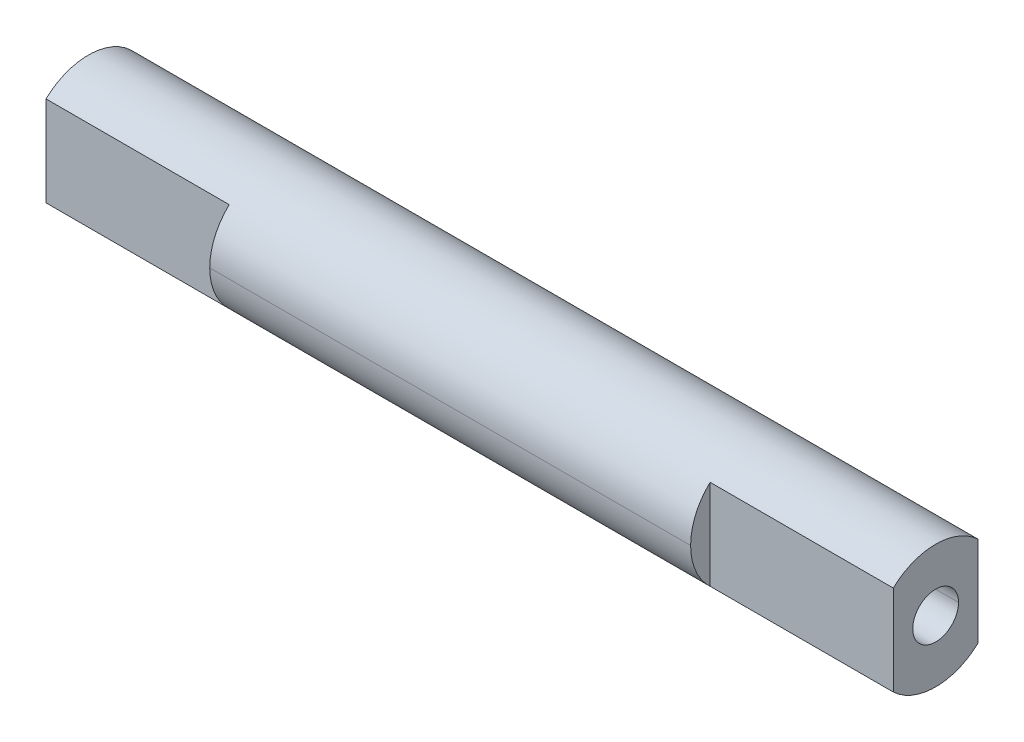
ISO-10303-21;
HEADER;
FILE_DESCRIPTION(('STEP AP214'),'2;1');
FILE_NAME('part.step','',(''),(''),'','','');
FILE_SCHEMA(('AUTOMOTIVE_DESIGN { 1 0 10303 214 1 1 1 1 }'));
ENDSEC;
DATA;
#1=APPLICATION_CONTEXT('core data for automotive mechanical design processes');
#2=APPLICATION_PROTOCOL_DEFINITION('international standard','automotive_design',2000,#1);
#3=PRODUCT_CONTEXT('',#1,'mechanical');
#4=PRODUCT('Part','Part','',(#3));
#5=PRODUCT_RELATED_PRODUCT_CATEGORY('part','',(#4));
#6=PRODUCT_DEFINITION_FORMATION('','',#4);
#7=PRODUCT_DEFINITION_CONTEXT('part definition',#1,'design');
#8=PRODUCT_DEFINITION('design','',#6,#7);
#9=PRODUCT_DEFINITION_SHAPE('','',#8);
#10=(LENGTH_UNIT() NAMED_UNIT(*) SI_UNIT(.MILLI.,.METRE.));
#11=(NAMED_UNIT(*) PLANE_ANGLE_UNIT() SI_UNIT($,.RADIAN.));
#12=(NAMED_UNIT(*) SI_UNIT($,.STERADIAN.) SOLID_ANGLE_UNIT());
#13=UNCERTAINTY_MEASURE_WITH_UNIT(LENGTH_MEASURE(1.E-05),#10,'distance_accuracy_value','');
#14=(GEOMETRIC_REPRESENTATION_CONTEXT(3) GLOBAL_UNCERTAINTY_ASSIGNED_CONTEXT((#13)) GLOBAL_UNIT_ASSIGNED_CONTEXT((#10,
#11,#12)) REPRESENTATION_CONTEXT('',''));
#15=CARTESIAN_POINT('',(0.,0.,0.));
#16=DIRECTION('',(0.,0.,1.));
#17=DIRECTION('',(1.,0.,0.));
#18=AXIS2_PLACEMENT_3D('',#15,#16,#17);
#19=CARTESIAN_POINT('',(-12.5,0.,0.));
#20=DIRECTION('',(-1.,0.,0.));
#21=DIRECTION('',(0.,0.,1.));
#22=AXIS2_PLACEMENT_3D('',#19,#20,#21);
#23=PLANE('',#22);
#24=CARTESIAN_POINT('',(-12.5,0.,0.));
#25=DIRECTION('',(1.,0.,0.));
#26=DIRECTION('',(0.,0.,-1.));
#27=AXIS2_PLACEMENT_3D('',#24,#25,#26);
#28=CIRCLE('',#27,1.);
#29=CARTESIAN_POINT('',(-12.5,0.,1.));
#30=VERTEX_POINT('',#29);
#31=CARTESIAN_POINT('',(-12.5,0.,-1.));
#32=VERTEX_POINT('',#31);
#33=EDGE_CURVE('E273',#30,#32,#28,.T.);
#34=ORIENTED_EDGE('',*,*,#33,.F.);
#35=CARTESIAN_POINT('',(-12.5,0.,0.));
#36=DIRECTION('',(1.,0.,0.));
#37=DIRECTION('',(0.,0.,-1.));
#38=AXIS2_PLACEMENT_3D('',#35,#36,#37);
#39=CIRCLE('',#38,1.);
#40=EDGE_CURVE('E11',#32,#30,#39,.T.);
#41=ORIENTED_EDGE('',*,*,#40,.F.);
#42=EDGE_LOOP('',(#34,#41));
#43=FACE_BOUND('',#42,.T.);
#44=ADVANCED_FACE('F16',(#43),#23,.T.);
#45=CARTESIAN_POINT('',(-12.5,0.,0.));
#46=DIRECTION('',(-1.,0.,0.));
#47=DIRECTION('',(0.,0.,1.));
#48=AXIS2_PLACEMENT_3D('',#45,#46,#47);
#49=CYLINDRICAL_SURFACE('',#48,1.);
#50=DIRECTION('',(-1.,0.,0.));
#51=VECTOR('',#50,1.);
#52=CARTESIAN_POINT('',(-12.5,0.,-1.));
#53=LINE('',#52,#51);
#54=CARTESIAN_POINT('',(-18.5,0.,-1.));
#55=VERTEX_POINT('',#54);
#56=EDGE_CURVE('E181',#32,#55,#53,.T.);
#57=ORIENTED_EDGE('',*,*,#56,.F.);
#58=ORIENTED_EDGE('',*,*,#40,.T.);
#59=DIRECTION('',(-1.,0.,0.));
#60=VECTOR('',#59,1.);
#61=CARTESIAN_POINT('',(-12.5,0.,1.));
#62=LINE('',#61,#60);
#63=CARTESIAN_POINT('',(-18.5,0.,1.));
#64=VERTEX_POINT('',#63);
#65=EDGE_CURVE('E177',#30,#64,#62,.T.);
#66=ORIENTED_EDGE('',*,*,#65,.T.);
#67=CARTESIAN_POINT('',(-18.5,0.,0.));
#68=DIRECTION('',(1.,0.,0.));
#69=DIRECTION('',(0.,0.,-1.));
#70=AXIS2_PLACEMENT_3D('',#67,#68,#69);
#71=CIRCLE('',#70,1.);
#72=EDGE_CURVE('E199',#55,#64,#71,.T.);
#73=ORIENTED_EDGE('',*,*,#72,.F.);
#74=EDGE_LOOP('',(#57,#58,#66,#73));
#75=FACE_BOUND('',#74,.T.);
#76=ADVANCED_FACE('F353',(#75),#49,.F.);
#77=CARTESIAN_POINT('',(-10.5,0.,0.));
#78=DIRECTION('',(-1.,0.,0.));
#79=DIRECTION('',(0.,0.,1.));
#80=AXIS2_PLACEMENT_3D('',#77,#78,#79);
#81=PLANE('',#80);
#82=CARTESIAN_POINT('',(-10.5,0.,0.));
#83=DIRECTION('',(1.,0.,0.));
#84=DIRECTION('',(0.,0.,-1.));
#85=AXIS2_PLACEMENT_3D('',#82,#83,#84);
#86=CIRCLE('',#85,2.7);
#87=CARTESIAN_POINT('',(-10.5,1.96659604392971,1.85));
#88=VERTEX_POINT('',#87);
#89=CARTESIAN_POINT('',(-10.5,0.,2.7));
#90=VERTEX_POINT('',#89);
#91=EDGE_CURVE('E188',#88,#90,#86,.T.);
#92=ORIENTED_EDGE('',*,*,#91,.F.);
#93=DIRECTION('',(0.,1.,0.));
#94=VECTOR('',#93,1.);
#95=CARTESIAN_POINT('',(-10.5,1.96659604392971,1.85));
#96=LINE('',#95,#94);
#97=CARTESIAN_POINT('',(-10.5,-1.96659604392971,1.85));
#98=VERTEX_POINT('',#97);
#99=EDGE_CURVE('E27',#98,#88,#96,.T.);
#100=ORIENTED_EDGE('',*,*,#99,.F.);
#101=CARTESIAN_POINT('',(-10.5,0.,0.));
#102=DIRECTION('',(1.,0.,0.));
#103=DIRECTION('',(0.,0.,-1.));
#104=AXIS2_PLACEMENT_3D('',#101,#102,#103);
#105=CIRCLE('',#104,2.7);
#106=EDGE_CURVE('E222',#90,#98,#105,.T.);
#107=ORIENTED_EDGE('',*,*,#106,.F.);
#108=EDGE_LOOP('',(#92,#100,#107));
#109=FACE_BOUND('',#108,.T.);
#110=ADVANCED_FACE('F330',(#109),#81,.T.);
#111=CARTESIAN_POINT('',(-10.5,1.96659604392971,1.85));
#112=DIRECTION('',(0.,0.,1.));
#113=DIRECTION('',(1.,0.,0.));
#114=AXIS2_PLACEMENT_3D('',#111,#112,#113);
#115=PLANE('',#114);
#116=DIRECTION('',(0.,1.,0.));
#117=VECTOR('',#116,1.);
#118=CARTESIAN_POINT('',(-18.5,1.96659604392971,1.85));
#119=LINE('',#118,#117);
#120=CARTESIAN_POINT('',(-18.5,-1.96659604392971,1.85));
#121=VERTEX_POINT('',#120);
#122=CARTESIAN_POINT('',(-18.5,1.96659604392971,1.85));
#123=VERTEX_POINT('',#122);
#124=EDGE_CURVE('E281',#121,#123,#119,.T.);
#125=ORIENTED_EDGE('',*,*,#124,.F.);
#126=DIRECTION('',(-1.,0.,0.));
#127=VECTOR('',#126,1.);
#128=CARTESIAN_POINT('',(-10.5,-1.96659604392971,1.85));
#129=LINE('',#128,#127);
#130=EDGE_CURVE('E217',#98,#121,#129,.T.);
#131=ORIENTED_EDGE('',*,*,#130,.F.);
#132=ORIENTED_EDGE('',*,*,#99,.T.);
#133=DIRECTION('',(-1.,0.,0.));
#134=VECTOR('',#133,1.);
#135=CARTESIAN_POINT('',(-10.5,1.96659604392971,1.85));
#136=LINE('',#135,#134);
#137=EDGE_CURVE('E193',#88,#123,#136,.T.);
#138=ORIENTED_EDGE('',*,*,#137,.T.);
#139=EDGE_LOOP('',(#125,#131,#132,#138));
#140=FACE_BOUND('',#139,.T.);
#141=ADVANCED_FACE('F332',(#140),#115,.T.);
#142=CARTESIAN_POINT('',(-10.5,0.,0.));
#143=DIRECTION('',(-1.,0.,0.));
#144=DIRECTION('',(0.,0.,1.));
#145=AXIS2_PLACEMENT_3D('',#142,#143,#144);
#146=PLANE('',#145);
#147=CARTESIAN_POINT('',(-10.5,0.,0.));
#148=DIRECTION('',(1.,0.,0.));
#149=DIRECTION('',(0.,0.,-1.));
#150=AXIS2_PLACEMENT_3D('',#147,#148,#149);
#151=CIRCLE('',#150,2.7);
#152=CARTESIAN_POINT('',(-10.5,-1.96659604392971,-1.85));
#153=VERTEX_POINT('',#152);
#154=CARTESIAN_POINT('',(-10.5,0.,-2.7));
#155=VERTEX_POINT('',#154);
#156=EDGE_CURVE('E287',#153,#155,#151,.T.);
#157=ORIENTED_EDGE('',*,*,#156,.F.);
#158=DIRECTION('',(0.,-1.,0.));
#159=VECTOR('',#158,1.);
#160=CARTESIAN_POINT('',(-10.5,1.96659604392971,-1.85));
#161=LINE('',#160,#159);
#162=CARTESIAN_POINT('',(-10.5,1.96659604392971,-1.85));
#163=VERTEX_POINT('',#162);
#164=EDGE_CURVE('E42',#163,#153,#161,.T.);
#165=ORIENTED_EDGE('',*,*,#164,.F.);
#166=CARTESIAN_POINT('',(-10.5,0.,0.));
#167=DIRECTION('',(1.,0.,0.));
#168=DIRECTION('',(0.,0.,-1.));
#169=AXIS2_PLACEMENT_3D('',#166,#167,#168);
#170=CIRCLE('',#169,2.7);
#171=EDGE_CURVE('E186',#155,#163,#170,.T.);
#172=ORIENTED_EDGE('',*,*,#171,.F.);
#173=EDGE_LOOP('',(#157,#165,#172));
#174=FACE_BOUND('',#173,.T.);
#175=ADVANCED_FACE('F341',(#174),#146,.T.);
#176=CARTESIAN_POINT('',(-10.5,1.96659604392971,-1.85));
#177=DIRECTION('',(0.,0.,-1.));
#178=DIRECTION('',(0.,-1.,0.));
#179=AXIS2_PLACEMENT_3D('',#176,#177,#178);
#180=PLANE('',#179);
#181=DIRECTION('',(0.,-1.,0.));
#182=VECTOR('',#181,1.);
#183=CARTESIAN_POINT('',(-18.5,1.96659604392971,-1.85));
#184=LINE('',#183,#182);
#185=CARTESIAN_POINT('',(-18.5,1.96659604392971,-1.85));
#186=VERTEX_POINT('',#185);
#187=CARTESIAN_POINT('',(-18.5,-1.96659604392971,-1.85));
#188=VERTEX_POINT('',#187);
#189=EDGE_CURVE('E202',#186,#188,#184,.T.);
#190=ORIENTED_EDGE('',*,*,#189,.F.);
#191=DIRECTION('',(-1.,0.,0.));
#192=VECTOR('',#191,1.);
#193=CARTESIAN_POINT('',(-10.5,1.96659604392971,-1.85));
#194=LINE('',#193,#192);
#195=EDGE_CURVE('E238',#163,#186,#194,.T.);
#196=ORIENTED_EDGE('',*,*,#195,.F.);
#197=ORIENTED_EDGE('',*,*,#164,.T.);
#198=DIRECTION('',(-1.,0.,0.));
#199=VECTOR('',#198,1.);
#200=CARTESIAN_POINT('',(-10.5,-1.96659604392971,-1.85));
#201=LINE('',#200,#199);
#202=EDGE_CURVE('E290',#153,#188,#201,.T.);
#203=ORIENTED_EDGE('',*,*,#202,.T.);
#204=EDGE_LOOP('',(#190,#196,#197,#203));
#205=FACE_BOUND('',#204,.T.);
#206=ADVANCED_FACE('F338',(#205),#180,.T.);
#207=CARTESIAN_POINT('',(12.5,0.,0.));
#208=DIRECTION('',(1.,0.,0.));
#209=DIRECTION('',(0.,1.,0.));
#210=AXIS2_PLACEMENT_3D('',#207,#208,#209);
#211=PLANE('',#210);
#212=CARTESIAN_POINT('',(12.5,0.,0.));
#213=DIRECTION('',(1.,0.,0.));
#214=DIRECTION('',(0.,0.,-1.));
#215=AXIS2_PLACEMENT_3D('',#212,#213,#214);
#216=CIRCLE('',#215,1.);
#217=CARTESIAN_POINT('',(12.5,0.,-1.));
#218=VERTEX_POINT('',#217);
#219=CARTESIAN_POINT('',(12.5,0.,1.));
#220=VERTEX_POINT('',#219);
#221=EDGE_CURVE('E208',#218,#220,#216,.T.);
#222=ORIENTED_EDGE('',*,*,#221,.T.);
#223=CARTESIAN_POINT('',(12.5,0.,0.));
#224=DIRECTION('',(1.,0.,0.));
#225=DIRECTION('',(0.,0.,-1.));
#226=AXIS2_PLACEMENT_3D('',#223,#224,#225);
#227=CIRCLE('',#226,1.);
#228=EDGE_CURVE('E169',#220,#218,#227,.T.);
#229=ORIENTED_EDGE('',*,*,#228,.T.);
#230=EDGE_LOOP('',(#222,#229));
#231=FACE_BOUND('',#230,.T.);
#232=ADVANCED_FACE('F340',(#231),#211,.T.);
#233=CARTESIAN_POINT('',(12.5,0.,0.));
#234=DIRECTION('',(1.,0.,0.));
#235=DIRECTION('',(0.,0.,-1.));
#236=AXIS2_PLACEMENT_3D('',#233,#234,#235);
#237=CYLINDRICAL_SURFACE('',#236,1.);
#238=DIRECTION('',(1.,0.,0.));
#239=VECTOR('',#238,1.);
#240=CARTESIAN_POINT('',(12.5,0.,1.));
#241=LINE('',#240,#239);
#242=CARTESIAN_POINT('',(18.5,0.,1.));
#243=VERTEX_POINT('',#242);
#244=EDGE_CURVE('E151',#220,#243,#241,.T.);
#245=ORIENTED_EDGE('',*,*,#244,.F.);
#246=ORIENTED_EDGE('',*,*,#221,.F.);
#247=DIRECTION('',(1.,0.,0.));
#248=VECTOR('',#247,1.);
#249=CARTESIAN_POINT('',(12.5,0.,-1.));
#250=LINE('',#249,#248);
#251=CARTESIAN_POINT('',(18.5,0.,-1.));
#252=VERTEX_POINT('',#251);
#253=EDGE_CURVE('E154',#218,#252,#250,.T.);
#254=ORIENTED_EDGE('',*,*,#253,.T.);
#255=CARTESIAN_POINT('',(18.5,0.,0.));
#256=DIRECTION('',(1.,0.,0.));
#257=DIRECTION('',(0.,0.,-1.));
#258=AXIS2_PLACEMENT_3D('',#255,#256,#257);
#259=CIRCLE('',#258,1.);
#260=EDGE_CURVE('E147',#252,#243,#259,.T.);
#261=ORIENTED_EDGE('',*,*,#260,.T.);
#262=EDGE_LOOP('',(#245,#246,#254,#261));
#263=FACE_BOUND('',#262,.T.);
#264=ADVANCED_FACE('F149',(#263),#237,.F.);
#265=CARTESIAN_POINT('',(10.5,0.,0.));
#266=DIRECTION('',(1.,0.,0.));
#267=DIRECTION('',(0.,1.,0.));
#268=AXIS2_PLACEMENT_3D('',#265,#266,#267);
#269=PLANE('',#268);
#270=CARTESIAN_POINT('',(10.5,0.,0.));
#271=DIRECTION('',(1.,0.,0.));
#272=DIRECTION('',(0.,0.,-1.));
#273=AXIS2_PLACEMENT_3D('',#270,#271,#272);
#274=CIRCLE('',#273,2.7);
#275=CARTESIAN_POINT('',(10.5,1.96659604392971,1.85));
#276=VERTEX_POINT('',#275);
#277=CARTESIAN_POINT('',(10.5,0.,2.7));
#278=VERTEX_POINT('',#277);
#279=EDGE_CURVE('E194',#276,#278,#274,.T.);
#280=ORIENTED_EDGE('',*,*,#279,.T.);
#281=CARTESIAN_POINT('',(10.5,0.,0.));
#282=DIRECTION('',(1.,0.,0.));
#283=DIRECTION('',(0.,0.,-1.));
#284=AXIS2_PLACEMENT_3D('',#281,#282,#283);
#285=CIRCLE('',#284,2.7);
#286=CARTESIAN_POINT('',(10.5,-1.96659604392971,1.85));
#287=VERTEX_POINT('',#286);
#288=EDGE_CURVE('E299',#278,#287,#285,.T.);
#289=ORIENTED_EDGE('',*,*,#288,.T.);
#290=DIRECTION('',(0.,1.,0.));
#291=VECTOR('',#290,1.);
#292=CARTESIAN_POINT('',(10.5,1.96659604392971,1.85));
#293=LINE('',#292,#291);
#294=EDGE_CURVE('E204',#287,#276,#293,.T.);
#295=ORIENTED_EDGE('',*,*,#294,.T.);
#296=EDGE_LOOP('',(#280,#289,#295));
#297=FACE_BOUND('',#296,.T.);
#298=ADVANCED_FACE('F312',(#297),#269,.T.);
#299=CARTESIAN_POINT('',(10.5,1.96659604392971,1.85));
#300=DIRECTION('',(0.,0.,-1.));
#301=DIRECTION('',(0.,-1.,0.));
#302=AXIS2_PLACEMENT_3D('',#299,#300,#301);
#303=PLANE('',#302);
#304=DIRECTION('',(0.,1.,0.));
#305=VECTOR('',#304,1.);
#306=CARTESIAN_POINT('',(18.5,1.96659604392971,1.85));
#307=LINE('',#306,#305);
#308=CARTESIAN_POINT('',(18.5,-1.96659604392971,1.85));
#309=VERTEX_POINT('',#308);
#310=CARTESIAN_POINT('',(18.5,1.96659604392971,1.85));
#311=VERTEX_POINT('',#310);
#312=EDGE_CURVE('E20',#309,#311,#307,.T.);
#313=ORIENTED_EDGE('',*,*,#312,.T.);
#314=DIRECTION('',(1.,0.,0.));
#315=VECTOR('',#314,1.);
#316=CARTESIAN_POINT('',(10.5,1.96659604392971,1.85));
#317=LINE('',#316,#315);
#318=EDGE_CURVE('E198',#276,#311,#317,.T.);
#319=ORIENTED_EDGE('',*,*,#318,.F.);
#320=ORIENTED_EDGE('',*,*,#294,.F.);
#321=DIRECTION('',(1.,0.,0.));
#322=VECTOR('',#321,1.);
#323=CARTESIAN_POINT('',(10.5,-1.96659604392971,1.85));
#324=LINE('',#323,#322);
#325=EDGE_CURVE('E259',#287,#309,#324,.T.);
#326=ORIENTED_EDGE('',*,*,#325,.T.);
#327=EDGE_LOOP('',(#313,#319,#320,#326));
#328=FACE_BOUND('',#327,.T.);
#329=ADVANCED_FACE('F322',(#328),#303,.F.);
#330=CARTESIAN_POINT('',(10.5,0.,0.));
#331=DIRECTION('',(1.,0.,0.));
#332=DIRECTION('',(0.,1.,0.));
#333=AXIS2_PLACEMENT_3D('',#330,#331,#332);
#334=PLANE('',#333);
#335=CARTESIAN_POINT('',(10.5,0.,0.));
#336=DIRECTION('',(1.,0.,0.));
#337=DIRECTION('',(0.,0.,-1.));
#338=AXIS2_PLACEMENT_3D('',#335,#336,#337);
#339=CIRCLE('',#338,2.7);
#340=CARTESIAN_POINT('',(10.5,-1.96659604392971,-1.85));
#341=VERTEX_POINT('',#340);
#342=CARTESIAN_POINT('',(10.5,0.,-2.7));
#343=VERTEX_POINT('',#342);
#344=EDGE_CURVE('E266',#341,#343,#339,.T.);
#345=ORIENTED_EDGE('',*,*,#344,.T.);
#346=CARTESIAN_POINT('',(10.5,0.,0.));
#347=DIRECTION('',(1.,0.,0.));
#348=DIRECTION('',(0.,0.,-1.));
#349=AXIS2_PLACEMENT_3D('',#346,#347,#348);
#350=CIRCLE('',#349,2.7);
#351=CARTESIAN_POINT('',(10.5,1.96659604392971,-1.85));
#352=VERTEX_POINT('',#351);
#353=EDGE_CURVE('E187',#343,#352,#350,.T.);
#354=ORIENTED_EDGE('',*,*,#353,.T.);
#355=DIRECTION('',(0.,-1.,0.));
#356=VECTOR('',#355,1.);
#357=CARTESIAN_POINT('',(10.5,1.96659604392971,-1.85));
#358=LINE('',#357,#356);
#359=EDGE_CURVE('E158',#352,#341,#358,.T.);
#360=ORIENTED_EDGE('',*,*,#359,.T.);
#361=EDGE_LOOP('',(#345,#354,#360));
#362=FACE_BOUND('',#361,.T.);
#363=ADVANCED_FACE('F371',(#362),#334,.T.);
#364=CARTESIAN_POINT('',(10.5,1.96659604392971,-1.85));
#365=DIRECTION('',(0.,0.,1.));
#366=DIRECTION('',(1.,0.,0.));
#367=AXIS2_PLACEMENT_3D('',#364,#365,#366);
#368=PLANE('',#367);
#369=DIRECTION('',(0.,-1.,0.));
#370=VECTOR('',#369,1.);
#371=CARTESIAN_POINT('',(18.5,1.96659604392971,-1.85));
#372=LINE('',#371,#370);
#373=CARTESIAN_POINT('',(18.5,1.96659604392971,-1.85));
#374=VERTEX_POINT('',#373);
#375=CARTESIAN_POINT('',(18.5,-1.96659604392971,-1.85));
#376=VERTEX_POINT('',#375);
#377=EDGE_CURVE('E159',#374,#376,#372,.T.);
#378=ORIENTED_EDGE('',*,*,#377,.T.);
#379=DIRECTION('',(1.,0.,0.));
#380=VECTOR('',#379,1.);
#381=CARTESIAN_POINT('',(10.5,-1.96659604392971,-1.85));
#382=LINE('',#381,#380);
#383=EDGE_CURVE('E260',#341,#376,#382,.T.);
#384=ORIENTED_EDGE('',*,*,#383,.F.);
#385=ORIENTED_EDGE('',*,*,#359,.F.);
#386=DIRECTION('',(1.,0.,0.));
#387=VECTOR('',#386,1.);
#388=CARTESIAN_POINT('',(10.5,1.96659604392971,-1.85));
#389=LINE('',#388,#387);
#390=EDGE_CURVE('E227',#352,#374,#389,.T.);
#391=ORIENTED_EDGE('',*,*,#390,.T.);
#392=EDGE_LOOP('',(#378,#384,#385,#391));
#393=FACE_BOUND('',#392,.T.);
#394=ADVANCED_FACE('F18',(#393),#368,.F.);
#395=CARTESIAN_POINT('',(18.5,0.,0.));
#396=DIRECTION('',(1.,0.,0.));
#397=DIRECTION('',(0.,1.,0.));
#398=AXIS2_PLACEMENT_3D('',#395,#396,#397);
#399=PLANE('',#398);
#400=ORIENTED_EDGE('',*,*,#260,.F.);
#401=CARTESIAN_POINT('',(18.5,0.,0.));
#402=DIRECTION('',(1.,0.,0.));
#403=DIRECTION('',(0.,0.,-1.));
#404=AXIS2_PLACEMENT_3D('',#401,#402,#403);
#405=CIRCLE('',#404,1.);
#406=EDGE_CURVE('E161',#243,#252,#405,.T.);
#407=ORIENTED_EDGE('',*,*,#406,.F.);
#408=EDGE_LOOP('',(#400,#407));
#409=FACE_BOUND('',#408,.T.);
#410=ORIENTED_EDGE('',*,*,#312,.F.);
#411=CARTESIAN_POINT('',(18.5,0.,0.));
#412=DIRECTION('',(1.,0.,0.));
#413=DIRECTION('',(0.,0.,-1.));
#414=AXIS2_PLACEMENT_3D('',#411,#412,#413);
#415=CIRCLE('',#414,2.7);
#416=EDGE_CURVE('E255',#309,#376,#415,.T.);
#417=ORIENTED_EDGE('',*,*,#416,.T.);
#418=ORIENTED_EDGE('',*,*,#377,.F.);
#419=CARTESIAN_POINT('',(18.5,0.,0.));
#420=DIRECTION('',(1.,0.,0.));
#421=DIRECTION('',(0.,0.,-1.));
#422=AXIS2_PLACEMENT_3D('',#419,#420,#421);
#423=CIRCLE('',#422,2.7);
#424=EDGE_CURVE('E223',#374,#311,#423,.T.);
#425=ORIENTED_EDGE('',*,*,#424,.T.);
#426=EDGE_LOOP('',(#410,#417,#418,#425));
#427=FACE_BOUND('',#426,.T.);
#428=ADVANCED_FACE('F162',(#409,#427),#399,.T.);
#429=CARTESIAN_POINT('',(-18.5,0.,0.));
#430=DIRECTION('',(1.,0.,0.));
#431=DIRECTION('',(0.,1.,0.));
#432=AXIS2_PLACEMENT_3D('',#429,#430,#431);
#433=PLANE('',#432);
#434=CARTESIAN_POINT('',(-18.5,0.,0.));
#435=DIRECTION('',(1.,0.,0.));
#436=DIRECTION('',(0.,0.,-1.));
#437=AXIS2_PLACEMENT_3D('',#434,#435,#436);
#438=CIRCLE('',#437,1.);
#439=EDGE_CURVE('E233',#64,#55,#438,.T.);
#440=ORIENTED_EDGE('',*,*,#439,.T.);
#441=ORIENTED_EDGE('',*,*,#72,.T.);
#442=EDGE_LOOP('',(#440,#441));
#443=FACE_BOUND('',#442,.T.);
#444=ORIENTED_EDGE('',*,*,#124,.T.);
#445=CARTESIAN_POINT('',(-18.5,0.,0.));
#446=DIRECTION('',(1.,0.,0.));
#447=DIRECTION('',(0.,0.,-1.));
#448=AXIS2_PLACEMENT_3D('',#445,#446,#447);
#449=CIRCLE('',#448,2.7);
#450=EDGE_CURVE('E246',#186,#123,#449,.T.);
#451=ORIENTED_EDGE('',*,*,#450,.F.);
#452=ORIENTED_EDGE('',*,*,#189,.T.);
#453=CARTESIAN_POINT('',(-18.5,0.,0.));
#454=DIRECTION('',(1.,0.,0.));
#455=DIRECTION('',(0.,0.,-1.));
#456=AXIS2_PLACEMENT_3D('',#453,#454,#455);
#457=CIRCLE('',#456,2.7);
#458=EDGE_CURVE('E221',#121,#188,#457,.T.);
#459=ORIENTED_EDGE('',*,*,#458,.F.);
#460=EDGE_LOOP('',(#444,#451,#452,#459));
#461=FACE_BOUND('',#460,.T.);
#462=ADVANCED_FACE('F336',(#443,#461),#433,.F.);
#463=CARTESIAN_POINT('',(18.5,0.,0.));
#464=DIRECTION('',(-1.,0.,0.));
#465=DIRECTION('',(0.,0.,1.));
#466=AXIS2_PLACEMENT_3D('',#463,#464,#465);
#467=CYLINDRICAL_SURFACE('',#466,2.7);
#468=DIRECTION('',(-1.,0.,0.));
#469=VECTOR('',#468,1.);
#470=CARTESIAN_POINT('',(18.5,0.,-2.7));
#471=LINE('',#470,#469);
#472=EDGE_CURVE('E183',#343,#155,#471,.T.);
#473=ORIENTED_EDGE('',*,*,#472,.F.);
#474=ORIENTED_EDGE('',*,*,#344,.F.);
#475=ORIENTED_EDGE('',*,*,#383,.T.);
#476=ORIENTED_EDGE('',*,*,#416,.F.);
#477=ORIENTED_EDGE('',*,*,#325,.F.);
#478=ORIENTED_EDGE('',*,*,#288,.F.);
#479=DIRECTION('',(-1.,0.,0.));
#480=VECTOR('',#479,1.);
#481=CARTESIAN_POINT('',(18.5,0.,2.7));
#482=LINE('',#481,#480);
#483=EDGE_CURVE('E192',#278,#90,#482,.T.);
#484=ORIENTED_EDGE('',*,*,#483,.T.);
#485=ORIENTED_EDGE('',*,*,#106,.T.);
#486=ORIENTED_EDGE('',*,*,#130,.T.);
#487=ORIENTED_EDGE('',*,*,#458,.T.);
#488=ORIENTED_EDGE('',*,*,#202,.F.);
#489=ORIENTED_EDGE('',*,*,#156,.T.);
#490=EDGE_LOOP('',(#473,#474,#475,#476,#477,#478,#484,#485,#486,#487,#488,#489));
#491=FACE_BOUND('',#490,.T.);
#492=ADVANCED_FACE('F320',(#491),#467,.T.);
#493=CARTESIAN_POINT('',(18.5,0.,0.));
#494=DIRECTION('',(-1.,0.,0.));
#495=DIRECTION('',(0.,0.,1.));
#496=AXIS2_PLACEMENT_3D('',#493,#494,#495);
#497=CYLINDRICAL_SURFACE('',#496,2.7);
#498=ORIENTED_EDGE('',*,*,#353,.F.);
#499=ORIENTED_EDGE('',*,*,#472,.T.);
#500=ORIENTED_EDGE('',*,*,#171,.T.);
#501=ORIENTED_EDGE('',*,*,#195,.T.);
#502=ORIENTED_EDGE('',*,*,#450,.T.);
#503=ORIENTED_EDGE('',*,*,#137,.F.);
#504=ORIENTED_EDGE('',*,*,#91,.T.);
#505=ORIENTED_EDGE('',*,*,#483,.F.);
#506=ORIENTED_EDGE('',*,*,#279,.F.);
#507=ORIENTED_EDGE('',*,*,#318,.T.);
#508=ORIENTED_EDGE('',*,*,#424,.F.);
#509=ORIENTED_EDGE('',*,*,#390,.F.);
#510=EDGE_LOOP('',(#498,#499,#500,#501,#502,#503,#504,#505,#506,#507,#508,#509));
#511=FACE_BOUND('',#510,.T.);
#512=ADVANCED_FACE('F325',(#511),#497,.T.);
#513=CARTESIAN_POINT('',(12.5,0.,0.));
#514=DIRECTION('',(1.,0.,0.));
#515=DIRECTION('',(0.,0.,-1.));
#516=AXIS2_PLACEMENT_3D('',#513,#514,#515);
#517=CYLINDRICAL_SURFACE('',#516,1.);
#518=ORIENTED_EDGE('',*,*,#228,.F.);
#519=ORIENTED_EDGE('',*,*,#244,.T.);
#520=ORIENTED_EDGE('',*,*,#406,.T.);
#521=ORIENTED_EDGE('',*,*,#253,.F.);
#522=EDGE_LOOP('',(#518,#519,#520,#521));
#523=FACE_BOUND('',#522,.T.);
#524=ADVANCED_FACE('F167',(#523),#517,.F.);
#525=CARTESIAN_POINT('',(-12.5,0.,0.));
#526=DIRECTION('',(-1.,0.,0.));
#527=DIRECTION('',(0.,0.,1.));
#528=AXIS2_PLACEMENT_3D('',#525,#526,#527);
#529=CYLINDRICAL_SURFACE('',#528,1.);
#530=ORIENTED_EDGE('',*,*,#33,.T.);
#531=ORIENTED_EDGE('',*,*,#56,.T.);
#532=ORIENTED_EDGE('',*,*,#439,.F.);
#533=ORIENTED_EDGE('',*,*,#65,.F.);
#534=EDGE_LOOP('',(#530,#531,#532,#533));
#535=FACE_BOUND('',#534,.T.);
#536=ADVANCED_FACE('F377',(#535),#529,.F.);
#537=CLOSED_SHELL('',(#44,#76,#110,#141,#175,#206,#232,#264,#298,#329,#363,#394,#428,#462,#492,
#512,#524,#536));
#538=MANIFOLD_SOLID_BREP('B1',#537);
#539=ADVANCED_BREP_SHAPE_REPRESENTATION('',(#18,#538),#14);
#540=SHAPE_DEFINITION_REPRESENTATION(#9,#539);
ENDSEC;
END-ISO-10303-21;
